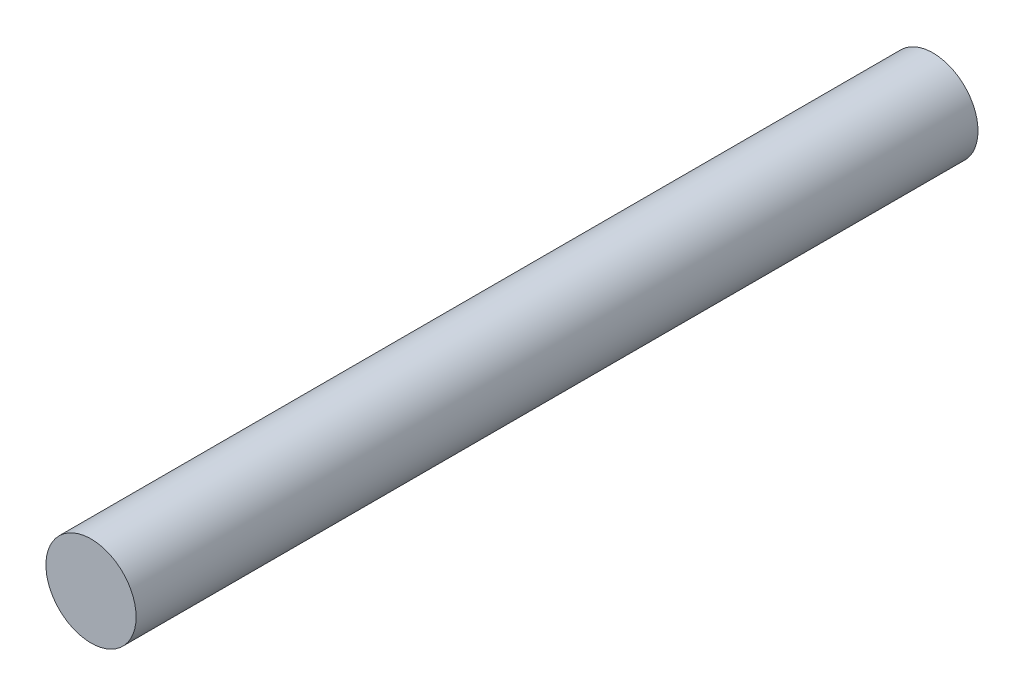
ISO-10303-21;
HEADER;
FILE_DESCRIPTION(('STEP AP214'),'2;1');
FILE_NAME('part.step','',(''),(''),'','','');
FILE_SCHEMA(('AUTOMOTIVE_DESIGN { 1 0 10303 214 1 1 1 1 }'));
ENDSEC;
DATA;
#1=APPLICATION_CONTEXT('core data for automotive mechanical design processes');
#2=APPLICATION_PROTOCOL_DEFINITION('international standard','automotive_design',2000,#1);
#3=PRODUCT_CONTEXT('',#1,'mechanical');
#4=PRODUCT('Part','Part','',(#3));
#5=PRODUCT_RELATED_PRODUCT_CATEGORY('part','',(#4));
#6=PRODUCT_DEFINITION_FORMATION('','',#4);
#7=PRODUCT_DEFINITION_CONTEXT('part definition',#1,'design');
#8=PRODUCT_DEFINITION('design','',#6,#7);
#9=PRODUCT_DEFINITION_SHAPE('','',#8);
#10=(LENGTH_UNIT() NAMED_UNIT(*) SI_UNIT(.MILLI.,.METRE.));
#11=(NAMED_UNIT(*) PLANE_ANGLE_UNIT() SI_UNIT($,.RADIAN.));
#12=(NAMED_UNIT(*) SI_UNIT($,.STERADIAN.) SOLID_ANGLE_UNIT());
#13=UNCERTAINTY_MEASURE_WITH_UNIT(LENGTH_MEASURE(1.E-05),#10,'distance_accuracy_value','');
#14=(GEOMETRIC_REPRESENTATION_CONTEXT(3) GLOBAL_UNCERTAINTY_ASSIGNED_CONTEXT((#13)) GLOBAL_UNIT_ASSIGNED_CONTEXT((#10,
#11,#12)) REPRESENTATION_CONTEXT('',''));
#15=CARTESIAN_POINT('',(0.,0.,0.));
#16=DIRECTION('',(0.,0.,1.));
#17=DIRECTION('',(1.,0.,0.));
#18=AXIS2_PLACEMENT_3D('',#15,#16,#17);
#19=CARTESIAN_POINT('',(0.,0.,88.9));
#20=DIRECTION('',(0.,0.,-1.));
#21=DIRECTION('',(-1.,0.,0.));
#22=AXIS2_PLACEMENT_3D('',#19,#20,#21);
#23=CYLINDRICAL_SURFACE('',#22,4.7625);
#24=CARTESIAN_POINT('',(0.,0.,88.9));
#25=DIRECTION('',(0.,0.,1.));
#26=DIRECTION('',(1.,0.,0.));
#27=AXIS2_PLACEMENT_3D('',#24,#25,#26);
#28=CIRCLE('',#27,4.7625);
#29=CARTESIAN_POINT('',(4.7625,0.,88.9));
#30=VERTEX_POINT('',#29);
#31=EDGE_CURVE('E10',#30,#30,#28,.T.);
#32=ORIENTED_EDGE('',*,*,#31,.F.);
#33=EDGE_LOOP('',(#32));
#34=FACE_BOUND('',#33,.T.);
#35=CARTESIAN_POINT('',(0.,0.,0.));
#36=DIRECTION('',(0.,0.,1.));
#37=DIRECTION('',(1.,0.,0.));
#38=AXIS2_PLACEMENT_3D('',#35,#36,#37);
#39=CIRCLE('',#38,4.7625);
#40=CARTESIAN_POINT('',(4.7625,0.,0.));
#41=VERTEX_POINT('',#40);
#42=EDGE_CURVE('E35',#41,#41,#39,.T.);
#43=ORIENTED_EDGE('',*,*,#42,.T.);
#44=EDGE_LOOP('',(#43));
#45=FACE_BOUND('',#44,.T.);
#46=ADVANCED_FACE('F29',(#34,#45),#23,.T.);
#47=CARTESIAN_POINT('',(0.,0.,88.9));
#48=DIRECTION('',(0.,0.,1.));
#49=DIRECTION('',(1.,0.,0.));
#50=AXIS2_PLACEMENT_3D('',#47,#48,#49);
#51=PLANE('',#50);
#52=ORIENTED_EDGE('',*,*,#31,.T.);
#53=EDGE_LOOP('',(#52));
#54=FACE_BOUND('',#53,.T.);
#55=ADVANCED_FACE('F44',(#54),#51,.T.);
#56=CARTESIAN_POINT('',(0.,0.,0.));
#57=DIRECTION('',(0.,0.,1.));
#58=DIRECTION('',(1.,0.,0.));
#59=AXIS2_PLACEMENT_3D('',#56,#57,#58);
#60=PLANE('',#59);
#61=ORIENTED_EDGE('',*,*,#42,.F.);
#62=EDGE_LOOP('',(#61));
#63=FACE_BOUND('',#62,.T.);
#64=ADVANCED_FACE('F42',(#63),#60,.F.);
#65=CLOSED_SHELL('',(#46,#55,#64));
#66=MANIFOLD_SOLID_BREP('B2',#65);
#67=ADVANCED_BREP_SHAPE_REPRESENTATION('',(#18,#66),#14);
#68=SHAPE_DEFINITION_REPRESENTATION(#9,#67);
ENDSEC;
END-ISO-10303-21;
